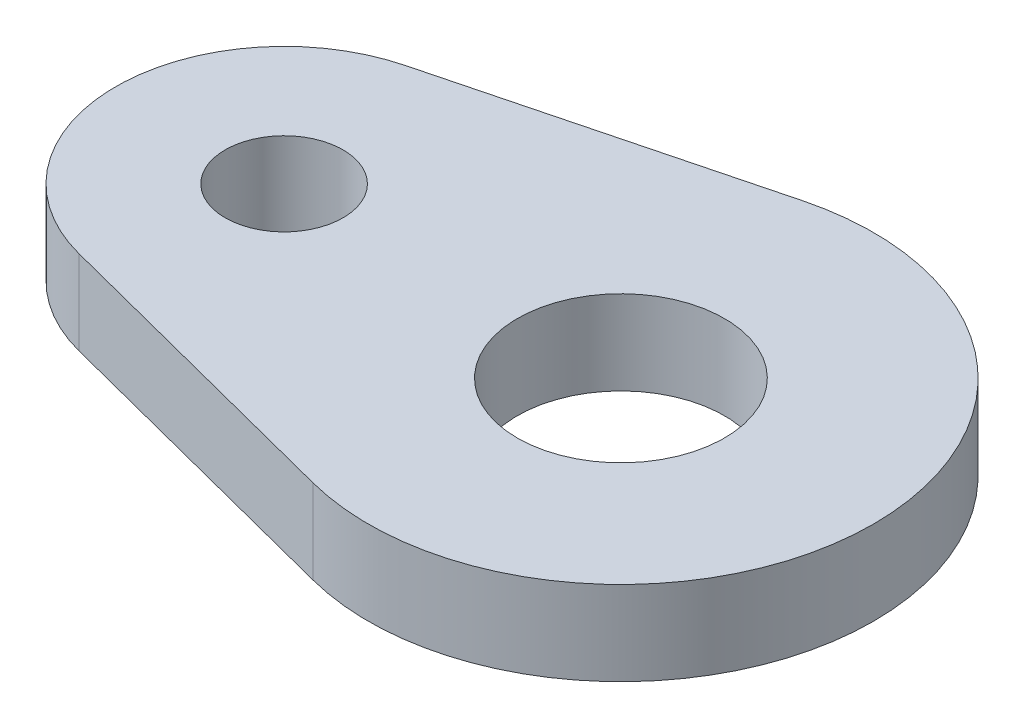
ISO-10303-21;
HEADER;
FILE_DESCRIPTION(('STEP AP214'),'2;1');
FILE_NAME('part.step','',(''),(''),'','','');
FILE_SCHEMA(('AUTOMOTIVE_DESIGN { 1 0 10303 214 1 1 1 1 }'));
ENDSEC;
DATA;
#1=APPLICATION_CONTEXT('core data for automotive mechanical design processes');
#2=APPLICATION_PROTOCOL_DEFINITION('international standard','automotive_design',2000,#1);
#3=PRODUCT_CONTEXT('',#1,'mechanical');
#4=PRODUCT('Part','Part','',(#3));
#5=PRODUCT_RELATED_PRODUCT_CATEGORY('part','',(#4));
#6=PRODUCT_DEFINITION_FORMATION('','',#4);
#7=PRODUCT_DEFINITION_CONTEXT('part definition',#1,'design');
#8=PRODUCT_DEFINITION('design','',#6,#7);
#9=PRODUCT_DEFINITION_SHAPE('','',#8);
#10=(LENGTH_UNIT() NAMED_UNIT(*) SI_UNIT(.MILLI.,.METRE.));
#11=(NAMED_UNIT(*) PLANE_ANGLE_UNIT() SI_UNIT($,.RADIAN.));
#12=(NAMED_UNIT(*) SI_UNIT($,.STERADIAN.) SOLID_ANGLE_UNIT());
#13=UNCERTAINTY_MEASURE_WITH_UNIT(LENGTH_MEASURE(1.E-05),#10,'distance_accuracy_value','');
#14=(GEOMETRIC_REPRESENTATION_CONTEXT(3) GLOBAL_UNCERTAINTY_ASSIGNED_CONTEXT((#13)) GLOBAL_UNIT_ASSIGNED_CONTEXT((#10,
#11,#12)) REPRESENTATION_CONTEXT('',''));
#15=CARTESIAN_POINT('',(0.,0.,0.));
#16=DIRECTION('',(0.,0.,1.));
#17=DIRECTION('',(1.,0.,0.));
#18=AXIS2_PLACEMENT_3D('',#15,#16,#17);
#19=CARTESIAN_POINT('',(-20.,0.,0.));
#20=DIRECTION('',(0.,-1.,0.));
#21=DIRECTION('',(0.,0.,-1.));
#22=AXIS2_PLACEMENT_3D('',#19,#20,#21);
#23=CYLINDRICAL_SURFACE('',#22,10.0000000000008);
#24=CARTESIAN_POINT('',(-20.,-5.,0.));
#25=DIRECTION('',(0.,-1.,0.));
#26=DIRECTION('',(0.,0.,-1.));
#27=AXIS2_PLACEMENT_3D('',#24,#25,#26);
#28=CIRCLE('',#27,10.0000000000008);
#29=CARTESIAN_POINT('',(-22.5,-5.,9.682458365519));
#30=VERTEX_POINT('',#29);
#31=CARTESIAN_POINT('',(-22.5000000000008,-5.,-9.68245836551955));
#32=VERTEX_POINT('',#31);
#33=EDGE_CURVE('E99',#30,#32,#28,.T.);
#34=ORIENTED_EDGE('',*,*,#33,.F.);
#35=DIRECTION('',(0.,-1.,0.));
#36=VECTOR('',#35,1.);
#37=CARTESIAN_POINT('',(-22.5,0.,9.682458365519));
#38=LINE('',#37,#36);
#39=CARTESIAN_POINT('',(-22.5,0.,9.682458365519));
#40=VERTEX_POINT('',#39);
#41=EDGE_CURVE('E11',#40,#30,#38,.T.);
#42=ORIENTED_EDGE('',*,*,#41,.F.);
#43=CARTESIAN_POINT('',(-20.,0.,0.));
#44=DIRECTION('',(0.,-1.,0.));
#45=DIRECTION('',(0.,0.,-1.));
#46=AXIS2_PLACEMENT_3D('',#43,#44,#45);
#47=CIRCLE('',#46,10.0000000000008);
#48=CARTESIAN_POINT('',(-22.5000000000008,0.,-9.68245836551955));
#49=VERTEX_POINT('',#48);
#50=EDGE_CURVE('E92',#40,#49,#47,.T.);
#51=ORIENTED_EDGE('',*,*,#50,.T.);
#52=DIRECTION('',(0.,-1.,0.));
#53=VECTOR('',#52,1.);
#54=CARTESIAN_POINT('',(-22.5000000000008,0.,-9.68245836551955));
#55=LINE('',#54,#53);
#56=EDGE_CURVE('E37',#49,#32,#55,.T.);
#57=ORIENTED_EDGE('',*,*,#56,.T.);
#58=EDGE_LOOP('',(#34,#42,#51,#57));
#59=FACE_BOUND('',#58,.T.);
#60=ADVANCED_FACE('F34',(#59),#23,.T.);
#61=CARTESIAN_POINT('',(-3.74999999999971,0.,14.5236875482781));
#62=DIRECTION('',(-0.249999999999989,0.,0.968245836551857));
#63=DIRECTION('',(0.968245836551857,0.,0.249999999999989));
#64=AXIS2_PLACEMENT_3D('',#61,#62,#63);
#65=PLANE('',#64);
#66=DIRECTION('',(-0.968245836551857,0.,-0.249999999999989));
#67=VECTOR('',#66,1.);
#68=CARTESIAN_POINT('',(-3.74999999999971,-5.,14.5236875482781));
#69=LINE('',#68,#67);
#70=CARTESIAN_POINT('',(-3.74999999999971,-5.,14.5236875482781));
#71=VERTEX_POINT('',#70);
#72=EDGE_CURVE('E94',#71,#30,#69,.T.);
#73=ORIENTED_EDGE('',*,*,#72,.F.);
#74=DIRECTION('',(0.,-1.,0.));
#75=VECTOR('',#74,1.);
#76=CARTESIAN_POINT('',(-3.74999999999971,0.,14.5236875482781));
#77=LINE('',#76,#75);
#78=CARTESIAN_POINT('',(-3.74999999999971,0.,14.5236875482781));
#79=VERTEX_POINT('',#78);
#80=EDGE_CURVE('E43',#79,#71,#77,.T.);
#81=ORIENTED_EDGE('',*,*,#80,.F.);
#82=DIRECTION('',(-0.968245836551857,0.,-0.249999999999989));
#83=VECTOR('',#82,1.);
#84=CARTESIAN_POINT('',(-3.74999999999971,0.,14.5236875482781));
#85=LINE('',#84,#83);
#86=EDGE_CURVE('E89',#79,#40,#85,.T.);
#87=ORIENTED_EDGE('',*,*,#86,.T.);
#88=ORIENTED_EDGE('',*,*,#41,.T.);
#89=EDGE_LOOP('',(#73,#81,#87,#88));
#90=FACE_BOUND('',#89,.T.);
#91=ADVANCED_FACE('F110',(#90),#65,.T.);
#92=CARTESIAN_POINT('',(0.,0.,-9.60305480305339E-13));
#93=DIRECTION('',(0.,-1.,0.));
#94=DIRECTION('',(0.,0.,-1.));
#95=AXIS2_PLACEMENT_3D('',#92,#93,#94);
#96=CYLINDRICAL_SURFACE('',#95,15.0000000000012);
#97=CARTESIAN_POINT('',(0.,-5.,-9.60305480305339E-13));
#98=DIRECTION('',(0.,-1.,0.));
#99=DIRECTION('',(0.,0.,-1.));
#100=AXIS2_PLACEMENT_3D('',#97,#98,#99);
#101=CIRCLE('',#100,15.0000000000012);
#102=CARTESIAN_POINT('',(-3.75000000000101,-5.,-14.5236875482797));
#103=VERTEX_POINT('',#102);
#104=EDGE_CURVE('E84',#103,#71,#101,.T.);
#105=ORIENTED_EDGE('',*,*,#104,.F.);
#106=DIRECTION('',(0.,-1.,0.));
#107=VECTOR('',#106,1.);
#108=CARTESIAN_POINT('',(-3.75000000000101,0.,-14.5236875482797));
#109=LINE('',#108,#107);
#110=CARTESIAN_POINT('',(-3.75000000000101,0.,-14.5236875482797));
#111=VERTEX_POINT('',#110);
#112=EDGE_CURVE('E79',#111,#103,#109,.T.);
#113=ORIENTED_EDGE('',*,*,#112,.F.);
#114=CARTESIAN_POINT('',(0.,0.,-9.60305480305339E-13));
#115=DIRECTION('',(0.,-1.,0.));
#116=DIRECTION('',(0.,0.,-1.));
#117=AXIS2_PLACEMENT_3D('',#114,#115,#116);
#118=CIRCLE('',#117,15.0000000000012);
#119=EDGE_CURVE('E82',#111,#79,#118,.T.);
#120=ORIENTED_EDGE('',*,*,#119,.T.);
#121=ORIENTED_EDGE('',*,*,#80,.T.);
#122=EDGE_LOOP('',(#105,#113,#120,#121));
#123=FACE_BOUND('',#122,.T.);
#124=ADVANCED_FACE('F81',(#123),#96,.T.);
#125=CARTESIAN_POINT('',(-22.5000000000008,0.,-9.68245836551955));
#126=DIRECTION('',(-0.250000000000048,0.,-0.968245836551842));
#127=DIRECTION('',(-0.968245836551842,0.,0.250000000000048));
#128=AXIS2_PLACEMENT_3D('',#125,#126,#127);
#129=PLANE('',#128);
#130=DIRECTION('',(0.968245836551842,0.,-0.250000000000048));
#131=VECTOR('',#130,1.);
#132=CARTESIAN_POINT('',(-22.5000000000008,-5.,-9.68245836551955));
#133=LINE('',#132,#131);
#134=EDGE_CURVE('E102',#32,#103,#133,.T.);
#135=ORIENTED_EDGE('',*,*,#134,.F.);
#136=ORIENTED_EDGE('',*,*,#56,.F.);
#137=DIRECTION('',(0.968245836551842,0.,-0.250000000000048));
#138=VECTOR('',#137,1.);
#139=CARTESIAN_POINT('',(-22.5000000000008,0.,-9.68245836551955));
#140=LINE('',#139,#138);
#141=EDGE_CURVE('E88',#49,#111,#140,.T.);
#142=ORIENTED_EDGE('',*,*,#141,.T.);
#143=ORIENTED_EDGE('',*,*,#112,.T.);
#144=EDGE_LOOP('',(#135,#136,#142,#143));
#145=FACE_BOUND('',#144,.T.);
#146=ADVANCED_FACE('F91',(#145),#129,.T.);
#147=CARTESIAN_POINT('',(-20.,0.,0.));
#148=DIRECTION('',(0.,-1.,0.));
#149=DIRECTION('',(0.,0.,-1.));
#150=AXIS2_PLACEMENT_3D('',#147,#148,#149);
#151=PLANE('',#150);
#152=CARTESIAN_POINT('',(-20.,0.,0.));
#153=DIRECTION('',(0.,-1.,0.));
#154=DIRECTION('',(0.,0.,1.));
#155=AXIS2_PLACEMENT_3D('',#152,#153,#154);
#156=CIRCLE('',#155,3.5);
#157=CARTESIAN_POINT('',(-20.,0.,3.5));
#158=VERTEX_POINT('',#157);
#159=EDGE_CURVE('E143',#158,#158,#156,.T.);
#160=ORIENTED_EDGE('',*,*,#159,.T.);
#161=EDGE_LOOP('',(#160));
#162=FACE_BOUND('',#161,.T.);
#163=CARTESIAN_POINT('',(0.,0.,-9.60305480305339E-13));
#164=DIRECTION('',(0.,-1.,0.));
#165=DIRECTION('',(0.,0.,1.));
#166=AXIS2_PLACEMENT_3D('',#163,#164,#165);
#167=CIRCLE('',#166,6.15000000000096);
#168=CARTESIAN_POINT('',(0.,0.,6.15));
#169=VERTEX_POINT('',#168);
#170=EDGE_CURVE('E103',#169,#169,#167,.T.);
#171=ORIENTED_EDGE('',*,*,#170,.T.);
#172=EDGE_LOOP('',(#171));
#173=FACE_BOUND('',#172,.T.);
#174=ORIENTED_EDGE('',*,*,#50,.F.);
#175=ORIENTED_EDGE('',*,*,#86,.F.);
#176=ORIENTED_EDGE('',*,*,#119,.F.);
#177=ORIENTED_EDGE('',*,*,#141,.F.);
#178=EDGE_LOOP('',(#174,#175,#176,#177));
#179=FACE_BOUND('',#178,.T.);
#180=ADVANCED_FACE('F87',(#162,#173,#179),#151,.F.);
#181=CARTESIAN_POINT('',(-20.,-5.,0.));
#182=DIRECTION('',(0.,-1.,0.));
#183=DIRECTION('',(0.,0.,-1.));
#184=AXIS2_PLACEMENT_3D('',#181,#182,#183);
#185=PLANE('',#184);
#186=CARTESIAN_POINT('',(-20.,-5.,0.));
#187=DIRECTION('',(0.,-1.,0.));
#188=DIRECTION('',(0.,0.,1.));
#189=AXIS2_PLACEMENT_3D('',#186,#187,#188);
#190=CIRCLE('',#189,3.5);
#191=CARTESIAN_POINT('',(-20.,-5.,3.5));
#192=VERTEX_POINT('',#191);
#193=EDGE_CURVE('E146',#192,#192,#190,.T.);
#194=ORIENTED_EDGE('',*,*,#193,.F.);
#195=EDGE_LOOP('',(#194));
#196=FACE_BOUND('',#195,.T.);
#197=CARTESIAN_POINT('',(0.,-5.,-9.60305480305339E-13));
#198=DIRECTION('',(0.,-1.,0.));
#199=DIRECTION('',(0.,0.,1.));
#200=AXIS2_PLACEMENT_3D('',#197,#198,#199);
#201=CIRCLE('',#200,6.15000000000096);
#202=CARTESIAN_POINT('',(0.,-5.,6.15));
#203=VERTEX_POINT('',#202);
#204=EDGE_CURVE('E148',#203,#203,#201,.T.);
#205=ORIENTED_EDGE('',*,*,#204,.F.);
#206=EDGE_LOOP('',(#205));
#207=FACE_BOUND('',#206,.T.);
#208=ORIENTED_EDGE('',*,*,#33,.T.);
#209=ORIENTED_EDGE('',*,*,#134,.T.);
#210=ORIENTED_EDGE('',*,*,#104,.T.);
#211=ORIENTED_EDGE('',*,*,#72,.T.);
#212=EDGE_LOOP('',(#208,#209,#210,#211));
#213=FACE_BOUND('',#212,.T.);
#214=ADVANCED_FACE('F109',(#196,#207,#213),#185,.T.);
#215=CARTESIAN_POINT('',(0.,0.,-9.60305480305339E-13));
#216=DIRECTION('',(0.,-1.,0.));
#217=DIRECTION('',(0.,0.,-1.));
#218=AXIS2_PLACEMENT_3D('',#215,#216,#217);
#219=CYLINDRICAL_SURFACE('',#218,6.15000000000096);
#220=ORIENTED_EDGE('',*,*,#170,.F.);
#221=EDGE_LOOP('',(#220));
#222=FACE_BOUND('',#221,.T.);
#223=ORIENTED_EDGE('',*,*,#204,.T.);
#224=EDGE_LOOP('',(#223));
#225=FACE_BOUND('',#224,.T.);
#226=ADVANCED_FACE('F128',(#222,#225),#219,.F.);
#227=CARTESIAN_POINT('',(-20.,0.,0.));
#228=DIRECTION('',(0.,-1.,0.));
#229=DIRECTION('',(0.,0.,-1.));
#230=AXIS2_PLACEMENT_3D('',#227,#228,#229);
#231=CYLINDRICAL_SURFACE('',#230,3.5);
#232=ORIENTED_EDGE('',*,*,#159,.F.);
#233=EDGE_LOOP('',(#232));
#234=FACE_BOUND('',#233,.T.);
#235=ORIENTED_EDGE('',*,*,#193,.T.);
#236=EDGE_LOOP('',(#235));
#237=FACE_BOUND('',#236,.T.);
#238=ADVANCED_FACE('F135',(#234,#237),#231,.F.);
#239=CLOSED_SHELL('',(#60,#91,#124,#146,#180,#214,#226,#238));
#240=MANIFOLD_SOLID_BREP('B2',#239);
#241=ADVANCED_BREP_SHAPE_REPRESENTATION('',(#18,#240),#14);
#242=SHAPE_DEFINITION_REPRESENTATION(#9,#241);
ENDSEC;
END-ISO-10303-21;
